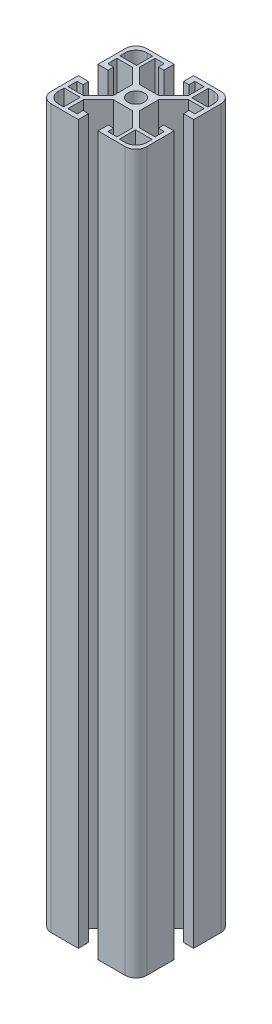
from build123d import *

# Parameters (mm, degrees)
SKETCH1_W           = 40
SKETCH1_H           = 40
BOSS_EXTRUDE1_DEPTH = 300
SKETCH2_R           = 3.4
SKETCH2_W           = 6.95
SKETCH2_H           = 6.75
SKETCH2_W_2         = 6.75
SKETCH2_H_2         = 6.95
CUT_EXTRUDE1_DEPTH  = 306.286750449
FILLET1_R           = 4.5


with BuildPart() as part:
    # Sketch1 → Boss-Extrude1 (new body)
    with BuildSketch(Plane(origin=(0, 0, 0), x_dir=(1, 0, 0), z_dir=(0, 1, 0))):
        with Locations((20, 20)):
            Rectangle(SKETCH1_W, SKETCH1_H)
    extrude(amount=BOSS_EXTRUDE1_DEPTH)

    # Sketch2 → Cut-Extrude1 (cut, through all)
    with BuildSketch(Plane(origin=(0, 300, 0), x_dir=(1, 0, 0), z_dir=(0, 1, 0))):
        with Locations(Location((20, 20, 0), (0, 0, 270))):
            Circle(SKETCH2_R)
        Polygon((30.25, 31.75), (24, 25.5), (16, 25.5), (9.75, 31.75), (9.75, 38.2), (13.6, 38.2), (13.6, 35.75), (15.9, 35.75), (15.9, 40), (24.1, 40), (24.1, 35.75), (26.4, 35.75), (26.4, 38.2), (30.25, 38.2), align=None)
        Polygon((31.75, 9.75), (25.5, 16), (25.5, 24), (31.75, 30.25), (38.2, 30.25), (38.2, 26.4), (35.75, 26.4), (35.75, 24.1), (40, 24.1), (40, 15.9), (35.75, 15.9), (35.75, 13.6), (38.2, 13.6), (38.2, 9.75), align=None)
        with Locations((4.975, 35.125)):
            Rectangle(SKETCH2_W, SKETCH2_H)
        with Locations((35.125, 35.025)):
            Rectangle(SKETCH2_W_2, SKETCH2_H_2)
        Polygon((9.75, 8.25), (16, 14.5), (24, 14.5), (30.25, 8.25), (30.25, 1.8), (26.4, 1.8), (26.4, 4.25), (24.1, 4.25), (24.1, 0), (15.9, 0), (15.9, 4.25), (13.6, 4.25), (13.6, 1.8), (9.75, 1.8), align=None)
        with Locations((35.025, 4.875)):
            Rectangle(SKETCH2_W, SKETCH2_H)
        Polygon((8.25, 30.25), (14.5, 24), (14.5, 16), (8.25, 9.75), (1.8, 9.75), (1.8, 13.6), (4.25, 13.6), (4.25, 15.9), (0, 15.9), (0, 24.1), (4.25, 24.1), (4.25, 26.4), (1.8, 26.4), (1.8, 30.25), align=None)
        with Locations((4.875, 4.975)):
            Rectangle(SKETCH2_W_2, SKETCH2_H_2)
    extrude(amount=-CUT_EXTRUDE1_DEPTH, mode=Mode.SUBTRACT)

    # Fillet1
    fillet1_edges = [part.edges().sort_by_distance(p)[0] for p in [
        (38.5, 150, -38.5),
        (1.5, 150, -1.5),
        (38.5, 150, -1.5),
        (0, 150, -40),
        (40, 150, -40),
        (40, 150, 0),
        (0, 150, 0),
        (1.5, 150, -38.5),
    ]]
    fillet(fillet1_edges, radius=FILLET1_R)


solid = part.part
